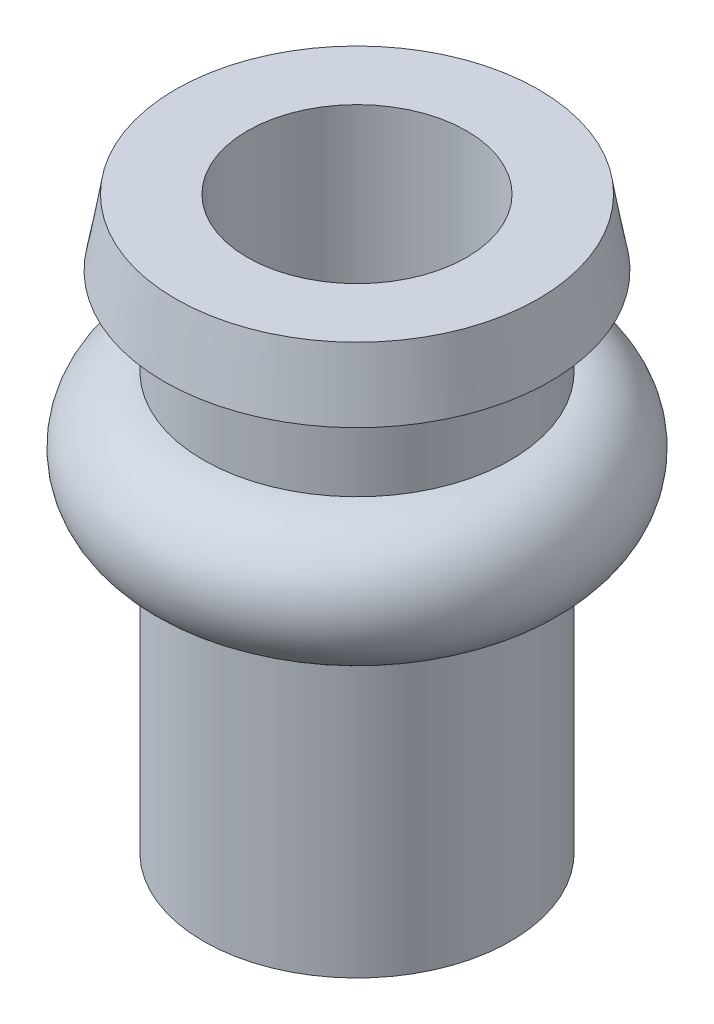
from build123d import *

# Parameters (mm, degrees)
SKIZZE2_R                       = 2.5
SCHNITT_LINEAR_AUSTRAGEN2_DEPTH = 15.798648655


with BuildPart() as part:
    # Skizze1 → Basis-Rotation (revolve)
    with BuildSketch(Plane.XY, mode=Mode.PRIVATE) as basis_rotation_sk:
        with BuildLine():
            Line((4.135509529, 13), (0, 13))
            Line((0, 13), (0, 0))
            Line((0, 0), (3.5, 0))
            Line((3.5, 0), (3.5, 6.5))
            ThreePointArc((3.5, 6.5), (5, 8), (3.5, 9.5))
            Line((3.5, 9.5), (3.5, 11.5))
            Line((3.5, 11.5), (4.4, 11.5))
            Line((4.4, 11.5), (4.135509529, 13))
        make_face()
    revolve(basis_rotation_sk.sketch.rotate(Axis((0, 38.953460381, 0), (0, -1, 0)), 90), axis=Axis((0, 38.953460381, 0), (0, -1, 0)))

    # Skizze2 → Schnitt-Linear austragen2 (cut, through all)
    with BuildSketch(Plane.XZ):
        with Locations(Location((0, 0, 0), (0, 0, 270))):
            Circle(SKIZZE2_R)
    extrude(amount=-SCHNITT_LINEAR_AUSTRAGEN2_DEPTH, mode=Mode.SUBTRACT)


solid = part.part
